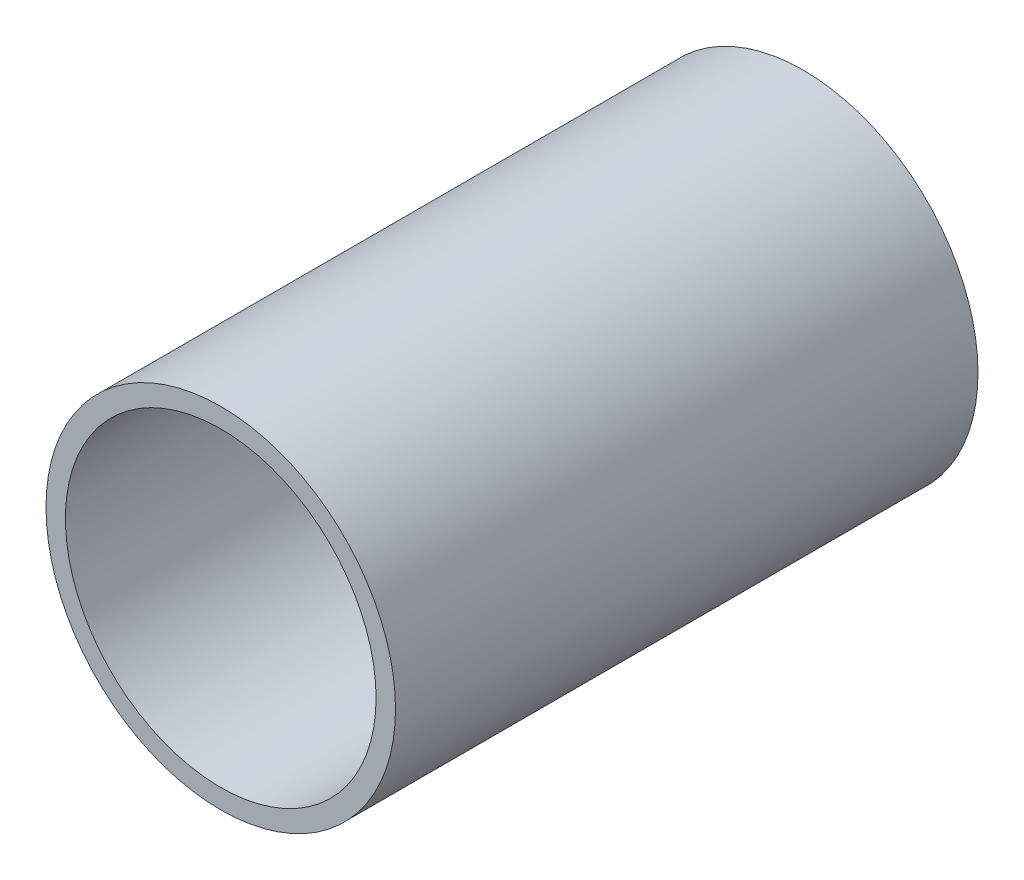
from build123d import *

# Parameters (mm, degrees)
ESQUISSE1_R          = 36
ESQUISSE1_R_2        = 32
BASE_EXTRUSION_DEPTH = 120


with BuildPart() as part:
    # Esquisse1 → Base-Extrusion (new body)
    with BuildSketch(Plane.XY):
        Circle(ESQUISSE1_R)
        Circle(ESQUISSE1_R_2, mode=Mode.SUBTRACT)
    extrude(amount=BASE_EXTRUSION_DEPTH)


solid = part.part
